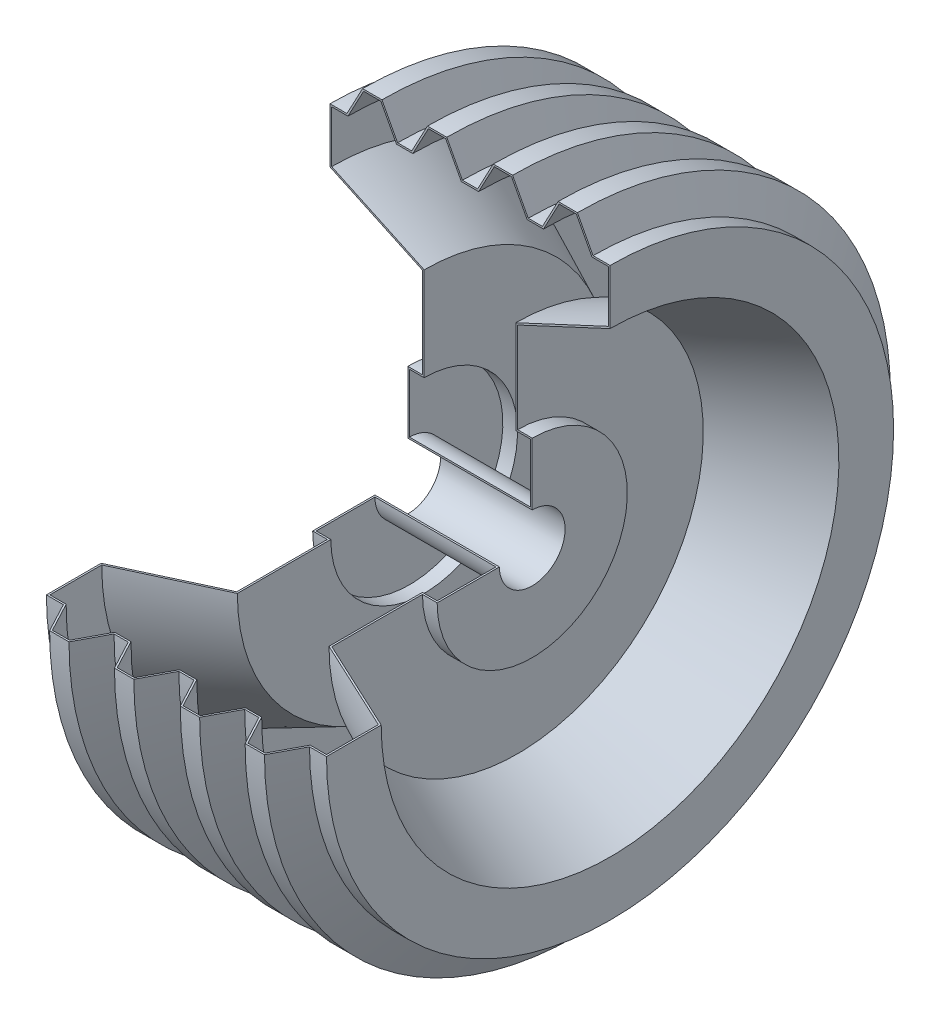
from build123d import *

# Parameters (mm, degrees)
REVOLVE_THIN1_ANGLE = 270


with BuildPart() as part:
    # Sketch1 → Revolve-Thin1 (revolve)
    with BuildSketch(Plane.XY):
        Polygon((-4.399139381, 164), (-13.438199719, 181), (-24.639920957, 181), (-33.678981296, 164), (-41.899139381, 164), (-50.938199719, 181), (-62.139920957, 181), (-71.178981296, 164), (-81, 164), (-81, 132.362929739), (-27.5, 107.415470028), (-27.5, 55), (-36, 55), (-36, 19), (36, 19), (36, 55), (27.5, 55), (27.5, 107.415470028), (81, 132.362929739), (81, 164), (71.178981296, 164), (62.139920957, 181), (50.938199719, 181), (41.899139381, 164), (33.678981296, 164), (24.639920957, 181), (13.438199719, 181), (4.399139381, 164), align=None)
        Polygon((-5, 163), (-14.039060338, 180), (-24.039060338, 180), (-33.078120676, 163), (-42.5, 163), (-51.539060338, 180), (-61.539060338, 180), (-70.578120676, 163), (-80, 163), (-80, 133), (-26.5, 108.052540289), (-26.5, 54), (-35, 54), (-35, 20), (35, 20), (35, 54), (26.5, 54), (26.5, 108.052540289), (80, 133), (80, 163), (70.578120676, 163), (61.539060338, 180), (51.539060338, 180), (42.5, 163), (33.078120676, 163), (24.039060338, 180), (14.039060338, 180), (5, 163), align=None, mode=Mode.SUBTRACT)
    revolve(axis=Axis((-137.234791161, 0, 0), (-1, 0, 0)), revolution_arc=REVOLVE_THIN1_ANGLE)


solid = part.part
